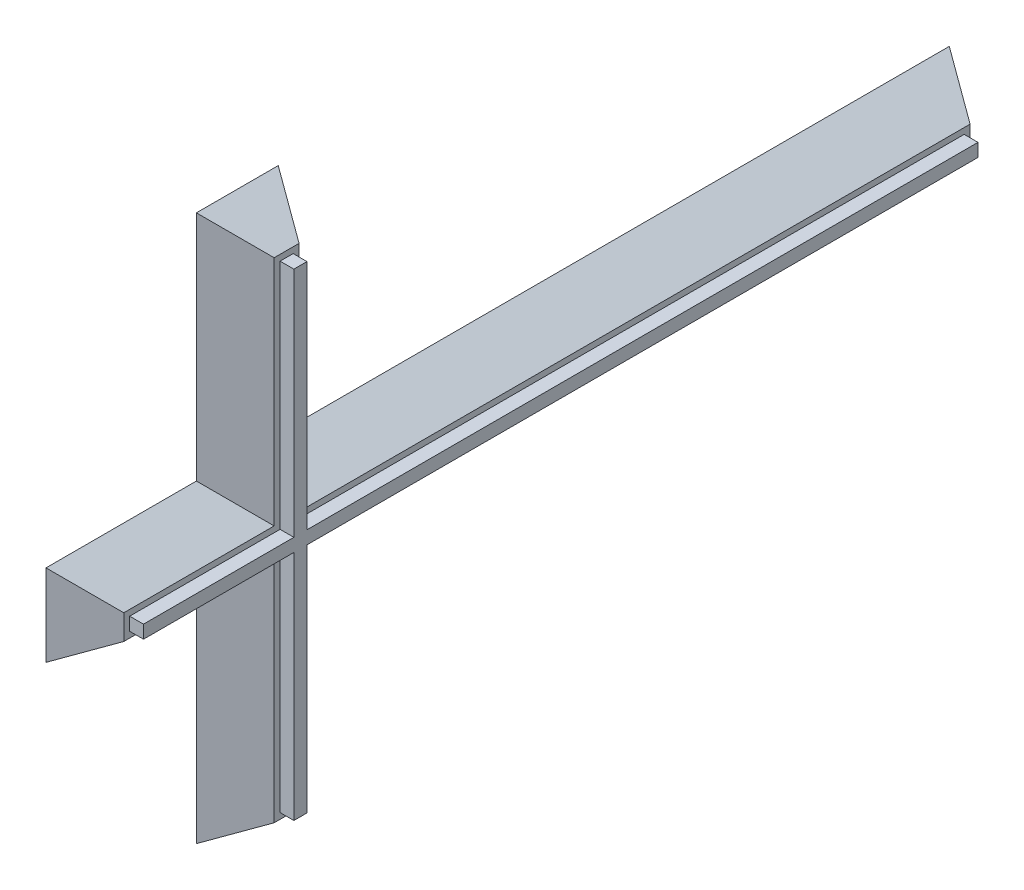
from build123d import *

# Parameters (mm, degrees)
BOSS_EXTRUDE1_DEPTH = 25
BOSS_EXTRUDE1_TAPER = 30
BOSS_EXTRUDE2_DEPTH = 7


with BuildPart() as part:
    # Sketch2 → Boss-Extrude1 (new body)
    with BuildSketch(Plane.YZ):
        Polygon((-20.75, 97), (-20.75, 20.75), (-138.475, 20.75), (-138.475, -20.75), (-20.75, -20.75), (-20.75, -361), (20.75, -361), (20.75, -20.75), (138.525, -20.75), (138.525, 20.75), (20.75, 20.75), (20.75, 97), align=None)
    extrude(amount=BOSS_EXTRUDE1_DEPTH, taper=BOSS_EXTRUDE1_TAPER)

    # Sketch3 → Boss-Extrude2 (add)
    with BuildSketch(Plane.YZ.offset(25)):
        Polygon((-121.04124327, -3.31624327), (-3.31624327, -3.31624327), (-3.31624327, -343.56624327), (3.31624327, -343.56624327), (3.31624327, -3.31624327), (121.09124327, -3.31624327), (121.09124327, 3.31624327), (3.31624327, 3.31624327), (3.31624327, 79.56624327), (-3.31624327, 79.56624327), (-3.31624327, 3.31624327), (-121.04124327, 3.31624327), align=None)
    extrude(amount=BOSS_EXTRUDE2_DEPTH)


solid = part.part
